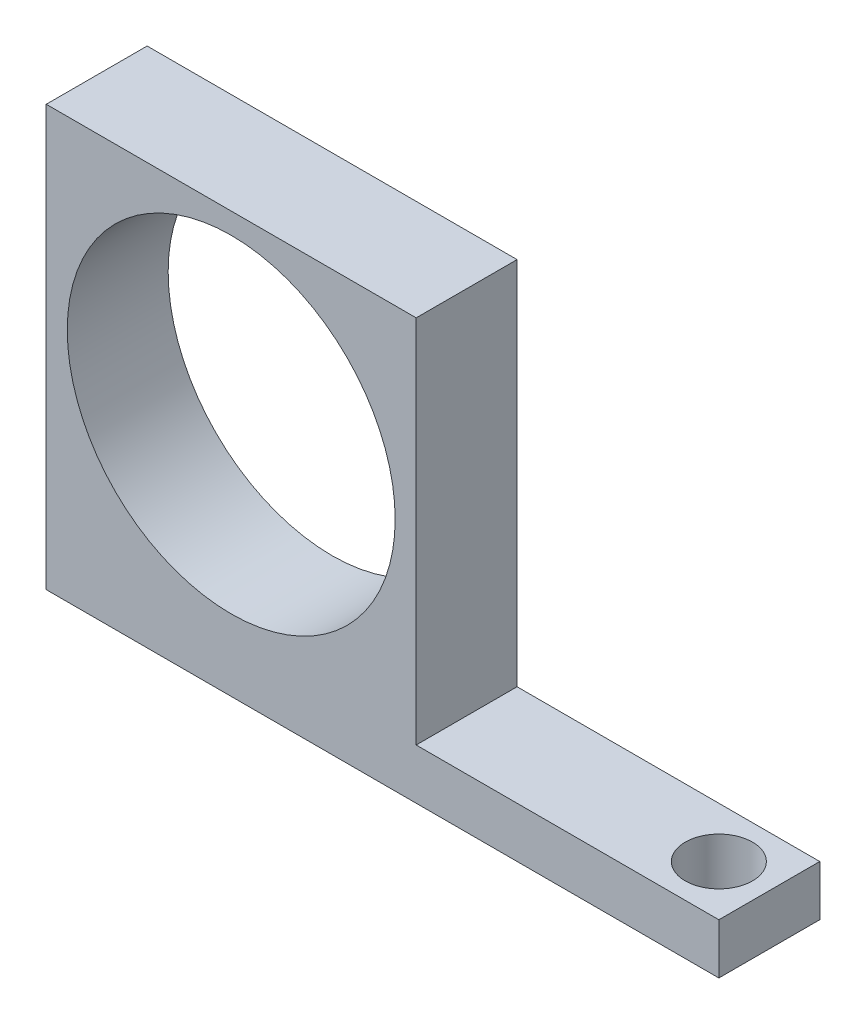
from build123d import *

# Parameters (mm, degrees)
SKETCH2_W           = 40
SKETCH2_H           = 6
SKETCH2_R           = 2
BOSS_EXTRUDE1_DEPTH = 3
SKETCH3_W           = 22
SKETCH3_H           = 6
BOSS_EXTRUDE2_DEPTH = 22
CUT_EXTRUDE1_REACH  = 49.55
SKETCH4_R           = 9.75


with BuildPart() as part:
    # Sketch2 → Boss-Extrude1 (new body)
    with BuildSketch(Plane(origin=(0, 0, 0), x_dir=(1, 0, 0), z_dir=(0, 1, 0))):
        with Locations((-20, 3)):
            Rectangle(SKETCH2_W, SKETCH2_H)
        with Locations(Location((-3, 3, 0), (0, 0, 270))):
            Circle(SKETCH2_R, mode=Mode.SUBTRACT)
    extrude(amount=BOSS_EXTRUDE1_DEPTH)

    # Sketch3 → Boss-Extrude2 (add)
    with BuildSketch(Plane(origin=(0, 3, 0), x_dir=(1, 0, 0), z_dir=(0, 1, 0))):
        with Locations((-29, 3)):
            Rectangle(SKETCH3_W, SKETCH3_H)
    extrude(amount=BOSS_EXTRUDE2_DEPTH)

    # Sketch4 → Cut-Extrude1 (cut, up to next)
    with BuildSketch(Plane(origin=(0, 0, -6), x_dir=(-1, 0, 0), z_dir=(0, 0, -1)), mode=Mode.PRIVATE) as cut_extrude1_sk1:
        with Locations((29, 14)):
            Circle(SKETCH4_R)
    cut_extrude1_tool1 = extrude(cut_extrude1_sk1.sketch, amount=-CUT_EXTRUDE1_REACH, mode=Mode.PRIVATE) & part.part
    add(cut_extrude1_tool1.solids().sort_by_distance((-29, 14, -6))[0], mode=Mode.SUBTRACT)


solid = part.part
